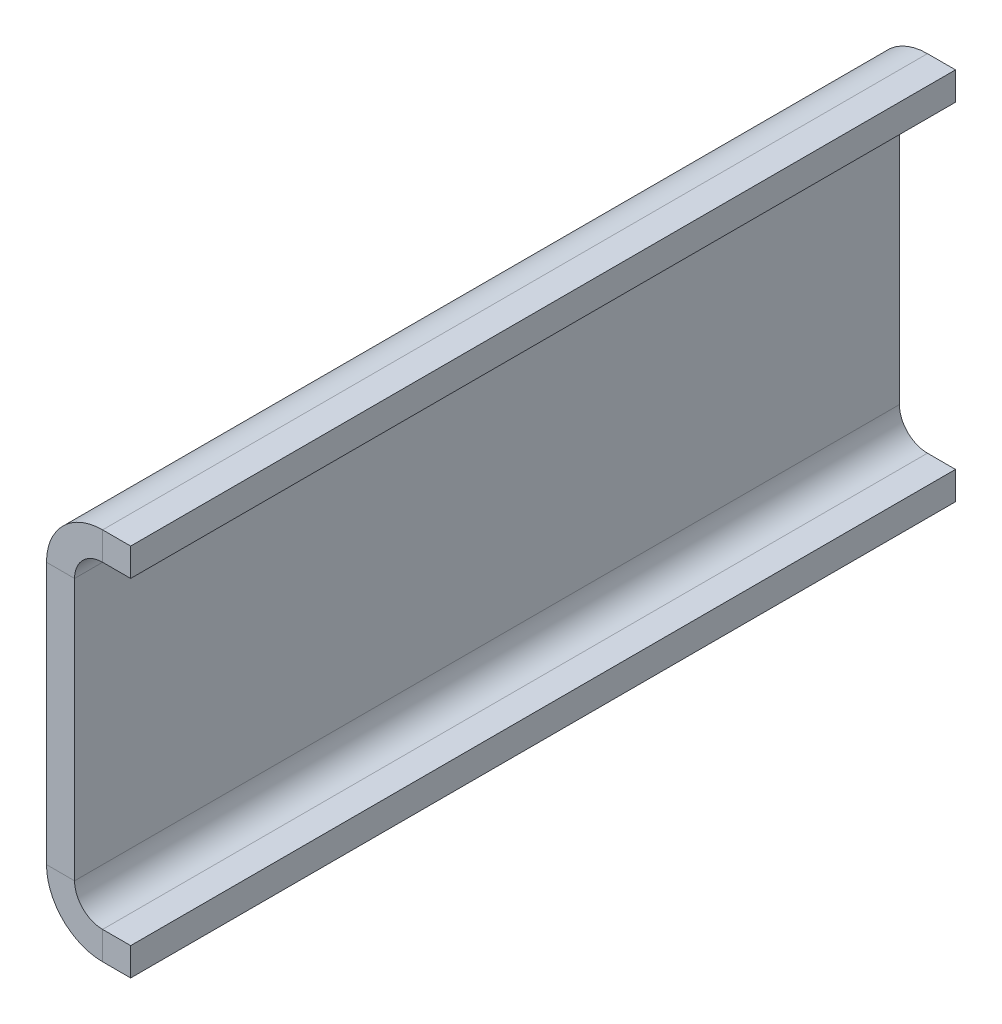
ISO-10303-21;
HEADER;
FILE_DESCRIPTION(('STEP AP214'),'2;1');
FILE_NAME('part.step','',(''),(''),'','','');
FILE_SCHEMA(('AUTOMOTIVE_DESIGN { 1 0 10303 214 1 1 1 1 }'));
ENDSEC;
DATA;
#1=APPLICATION_CONTEXT('core data for automotive mechanical design processes');
#2=APPLICATION_PROTOCOL_DEFINITION('international standard','automotive_design',2000,#1);
#3=PRODUCT_CONTEXT('',#1,'mechanical');
#4=PRODUCT('Part','Part','',(#3));
#5=PRODUCT_RELATED_PRODUCT_CATEGORY('part','',(#4));
#6=PRODUCT_DEFINITION_FORMATION('','',#4);
#7=PRODUCT_DEFINITION_CONTEXT('part definition',#1,'design');
#8=PRODUCT_DEFINITION('design','',#6,#7);
#9=PRODUCT_DEFINITION_SHAPE('','',#8);
#10=(LENGTH_UNIT() NAMED_UNIT(*) SI_UNIT(.MILLI.,.METRE.));
#11=(NAMED_UNIT(*) PLANE_ANGLE_UNIT() SI_UNIT($,.RADIAN.));
#12=(NAMED_UNIT(*) SI_UNIT($,.STERADIAN.) SOLID_ANGLE_UNIT());
#13=UNCERTAINTY_MEASURE_WITH_UNIT(LENGTH_MEASURE(1.E-05),#10,'distance_accuracy_value','');
#14=(GEOMETRIC_REPRESENTATION_CONTEXT(3) GLOBAL_UNCERTAINTY_ASSIGNED_CONTEXT((#13)) GLOBAL_UNIT_ASSIGNED_CONTEXT((#10,
#11,#12)) REPRESENTATION_CONTEXT('',''));
#15=CARTESIAN_POINT('',(0.,0.,0.));
#16=DIRECTION('',(0.,0.,1.));
#17=DIRECTION('',(1.,0.,0.));
#18=AXIS2_PLACEMENT_3D('',#15,#16,#17);
#19=CARTESIAN_POINT('',(-3.,-14.,88.2));
#20=DIRECTION('',(0.,0.,1.));
#21=DIRECTION('',(1.,0.,0.));
#22=AXIS2_PLACEMENT_3D('',#19,#20,#21);
#23=PLANE('',#22);
#24=DIRECTION('',(1.,0.,0.));
#25=VECTOR('',#24,1.);
#26=CARTESIAN_POINT('',(0.,-20.,88.2));
#27=LINE('',#26,#25);
#28=CARTESIAN_POINT('',(3.,-20.,88.2));
#29=VERTEX_POINT('',#28);
#30=CARTESIAN_POINT('',(6.00000000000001,-20.,88.2));
#31=VERTEX_POINT('',#30);
#32=EDGE_CURVE('E190',#29,#31,#27,.T.);
#33=ORIENTED_EDGE('',*,*,#32,.T.);
#34=DIRECTION('',(0.,-1.,0.));
#35=VECTOR('',#34,1.);
#36=CARTESIAN_POINT('',(6.00000000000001,-17.,88.2));
#37=LINE('',#36,#35);
#38=CARTESIAN_POINT('',(6.00000000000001,-17.,88.2));
#39=VERTEX_POINT('',#38);
#40=EDGE_CURVE('E148',#39,#31,#37,.T.);
#41=ORIENTED_EDGE('',*,*,#40,.F.);
#42=DIRECTION('',(1.,0.,0.));
#43=VECTOR('',#42,1.);
#44=CARTESIAN_POINT('',(0.,-17.,88.2));
#45=LINE('',#44,#43);
#46=CARTESIAN_POINT('',(3.,-17.,88.2));
#47=VERTEX_POINT('',#46);
#48=EDGE_CURVE('E146',#47,#39,#45,.T.);
#49=ORIENTED_EDGE('',*,*,#48,.F.);
#50=DIRECTION('',(0.,-1.,0.));
#51=VECTOR('',#50,1.);
#52=CARTESIAN_POINT('',(3.,-17.,88.2));
#53=LINE('',#52,#51);
#54=EDGE_CURVE('E231',#47,#29,#53,.T.);
#55=ORIENTED_EDGE('',*,*,#54,.T.);
#56=EDGE_LOOP('',(#33,#41,#49,#55));
#57=FACE_BOUND('',#56,.T.);
#58=ADVANCED_FACE('F41',(#57),#23,.T.);
#59=CARTESIAN_POINT('',(0.,-20.,88.2));
#60=DIRECTION('',(0.,1.,0.));
#61=DIRECTION('',(0.,0.,1.));
#62=AXIS2_PLACEMENT_3D('',#59,#60,#61);
#63=PLANE('',#62);
#64=DIRECTION('',(0.,0.,-1.));
#65=VECTOR('',#64,1.);
#66=CARTESIAN_POINT('',(6.00000000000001,-20.,88.2));
#67=LINE('',#66,#65);
#68=CARTESIAN_POINT('',(6.00000000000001,-20.,0.));
#69=VERTEX_POINT('',#68);
#70=EDGE_CURVE('E57',#31,#69,#67,.T.);
#71=ORIENTED_EDGE('',*,*,#70,.F.);
#72=ORIENTED_EDGE('',*,*,#32,.F.);
#73=DIRECTION('',(0.,0.,-1.));
#74=VECTOR('',#73,1.);
#75=CARTESIAN_POINT('',(3.,-20.,88.2));
#76=LINE('',#75,#74);
#77=CARTESIAN_POINT('',(3.,-20.,0.));
#78=VERTEX_POINT('',#77);
#79=EDGE_CURVE('E191',#29,#78,#76,.T.);
#80=ORIENTED_EDGE('',*,*,#79,.T.);
#81=DIRECTION('',(1.,0.,0.));
#82=VECTOR('',#81,1.);
#83=CARTESIAN_POINT('',(0.,-20.,0.));
#84=LINE('',#83,#82);
#85=EDGE_CURVE('E155',#78,#69,#84,.T.);
#86=ORIENTED_EDGE('',*,*,#85,.T.);
#87=EDGE_LOOP('',(#71,#72,#80,#86));
#88=FACE_BOUND('',#87,.T.);
#89=ADVANCED_FACE('F294',(#88),#63,.F.);
#90=CARTESIAN_POINT('',(0.,-17.,88.2));
#91=DIRECTION('',(0.,1.,0.));
#92=DIRECTION('',(0.,0.,1.));
#93=AXIS2_PLACEMENT_3D('',#90,#91,#92);
#94=PLANE('',#93);
#95=ORIENTED_EDGE('',*,*,#48,.T.);
#96=DIRECTION('',(0.,0.,1.));
#97=VECTOR('',#96,1.);
#98=CARTESIAN_POINT('',(6.00000000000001,-17.,0.));
#99=LINE('',#98,#97);
#100=CARTESIAN_POINT('',(6.00000000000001,-17.,0.));
#101=VERTEX_POINT('',#100);
#102=EDGE_CURVE('E130',#101,#39,#99,.T.);
#103=ORIENTED_EDGE('',*,*,#102,.F.);
#104=DIRECTION('',(1.,0.,0.));
#105=VECTOR('',#104,1.);
#106=CARTESIAN_POINT('',(0.,-17.,0.));
#107=LINE('',#106,#105);
#108=CARTESIAN_POINT('',(3.,-17.,0.));
#109=VERTEX_POINT('',#108);
#110=EDGE_CURVE('E143',#109,#101,#107,.T.);
#111=ORIENTED_EDGE('',*,*,#110,.F.);
#112=DIRECTION('',(0.,0.,-1.));
#113=VECTOR('',#112,1.);
#114=CARTESIAN_POINT('',(3.,-17.,88.2));
#115=LINE('',#114,#113);
#116=EDGE_CURVE('E220',#47,#109,#115,.T.);
#117=ORIENTED_EDGE('',*,*,#116,.F.);
#118=EDGE_LOOP('',(#95,#103,#111,#117));
#119=FACE_BOUND('',#118,.T.);
#120=ADVANCED_FACE('F141',(#119),#94,.T.);
#121=CARTESIAN_POINT('',(3.,-14.,0.));
#122=DIRECTION('',(0.,0.,-1.));
#123=DIRECTION('',(-1.,0.,0.));
#124=AXIS2_PLACEMENT_3D('',#121,#122,#123);
#125=PLANE('',#124);
#126=ORIENTED_EDGE('',*,*,#110,.T.);
#127=DIRECTION('',(0.,1.,0.));
#128=VECTOR('',#127,1.);
#129=CARTESIAN_POINT('',(6.00000000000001,-20.,0.));
#130=LINE('',#129,#128);
#131=EDGE_CURVE('E127',#69,#101,#130,.T.);
#132=ORIENTED_EDGE('',*,*,#131,.F.);
#133=ORIENTED_EDGE('',*,*,#85,.F.);
#134=DIRECTION('',(0.,1.,0.));
#135=VECTOR('',#134,1.);
#136=CARTESIAN_POINT('',(3.,-20.,0.));
#137=LINE('',#136,#135);
#138=EDGE_CURVE('E151',#78,#109,#137,.T.);
#139=ORIENTED_EDGE('',*,*,#138,.T.);
#140=EDGE_LOOP('',(#126,#132,#133,#139));
#141=FACE_BOUND('',#140,.T.);
#142=ADVANCED_FACE('F150',(#141),#125,.T.);
#143=CARTESIAN_POINT('',(-3.,14.,0.));
#144=DIRECTION('',(0.,0.,-1.));
#145=DIRECTION('',(-1.,0.,0.));
#146=AXIS2_PLACEMENT_3D('',#143,#144,#145);
#147=PLANE('',#146);
#148=DIRECTION('',(1.,0.,0.));
#149=VECTOR('',#148,1.);
#150=CARTESIAN_POINT('',(0.,20.,0.));
#151=LINE('',#150,#149);
#152=CARTESIAN_POINT('',(6.,20.,0.));
#153=VERTEX_POINT('',#152);
#154=CARTESIAN_POINT('',(3.,20.,0.));
#155=VERTEX_POINT('',#154);
#156=EDGE_CURVE('E175',#153,#155,#151,.F.);
#157=ORIENTED_EDGE('',*,*,#156,.F.);
#158=DIRECTION('',(0.,1.,0.));
#159=VECTOR('',#158,1.);
#160=CARTESIAN_POINT('',(6.,17.,0.));
#161=LINE('',#160,#159);
#162=CARTESIAN_POINT('',(6.,17.,0.));
#163=VERTEX_POINT('',#162);
#164=EDGE_CURVE('E338',#163,#153,#161,.T.);
#165=ORIENTED_EDGE('',*,*,#164,.F.);
#166=DIRECTION('',(-1.,0.,0.));
#167=VECTOR('',#166,1.);
#168=CARTESIAN_POINT('',(0.,17.,0.));
#169=LINE('',#168,#167);
#170=CARTESIAN_POINT('',(3.,17.,0.));
#171=VERTEX_POINT('',#170);
#172=EDGE_CURVE('E172',#163,#171,#169,.T.);
#173=ORIENTED_EDGE('',*,*,#172,.T.);
#174=DIRECTION('',(0.,1.,0.));
#175=VECTOR('',#174,1.);
#176=CARTESIAN_POINT('',(3.,17.,0.));
#177=LINE('',#176,#175);
#178=EDGE_CURVE('E237',#171,#155,#177,.T.);
#179=ORIENTED_EDGE('',*,*,#178,.T.);
#180=EDGE_LOOP('',(#157,#165,#173,#179));
#181=FACE_BOUND('',#180,.T.);
#182=ADVANCED_FACE('F329',(#181),#147,.T.);
#183=CARTESIAN_POINT('',(0.,17.,88.2));
#184=DIRECTION('',(0.,-1.,0.));
#185=DIRECTION('',(0.,0.,-1.));
#186=AXIS2_PLACEMENT_3D('',#183,#184,#185);
#187=PLANE('',#186);
#188=ORIENTED_EDGE('',*,*,#172,.F.);
#189=DIRECTION('',(0.,0.,-1.));
#190=VECTOR('',#189,1.);
#191=CARTESIAN_POINT('',(6.,17.,88.2));
#192=LINE('',#191,#190);
#193=CARTESIAN_POINT('',(6.,17.,88.2));
#194=VERTEX_POINT('',#193);
#195=EDGE_CURVE('E341',#194,#163,#192,.T.);
#196=ORIENTED_EDGE('',*,*,#195,.F.);
#197=DIRECTION('',(-1.,0.,0.));
#198=VECTOR('',#197,1.);
#199=CARTESIAN_POINT('',(0.,17.,88.2));
#200=LINE('',#199,#198);
#201=CARTESIAN_POINT('',(3.,17.,88.2));
#202=VERTEX_POINT('',#201);
#203=EDGE_CURVE('E247',#194,#202,#200,.T.);
#204=ORIENTED_EDGE('',*,*,#203,.T.);
#205=DIRECTION('',(0.,0.,-1.));
#206=VECTOR('',#205,1.);
#207=CARTESIAN_POINT('',(3.,17.,88.2));
#208=LINE('',#207,#206);
#209=EDGE_CURVE('E208',#202,#171,#208,.T.);
#210=ORIENTED_EDGE('',*,*,#209,.T.);
#211=EDGE_LOOP('',(#188,#196,#204,#210));
#212=FACE_BOUND('',#211,.T.);
#213=ADVANCED_FACE('F362',(#212),#187,.T.);
#214=CARTESIAN_POINT('',(0.,20.,88.2));
#215=DIRECTION('',(0.,-1.,0.));
#216=DIRECTION('',(0.,0.,-1.));
#217=AXIS2_PLACEMENT_3D('',#214,#215,#216);
#218=PLANE('',#217);
#219=DIRECTION('',(0.,0.,1.));
#220=VECTOR('',#219,1.);
#221=CARTESIAN_POINT('',(6.,20.,0.));
#222=LINE('',#221,#220);
#223=CARTESIAN_POINT('',(6.,20.,88.2));
#224=VERTEX_POINT('',#223);
#225=EDGE_CURVE('E65',#153,#224,#222,.T.);
#226=ORIENTED_EDGE('',*,*,#225,.F.);
#227=ORIENTED_EDGE('',*,*,#156,.T.);
#228=DIRECTION('',(0.,0.,-1.));
#229=VECTOR('',#228,1.);
#230=CARTESIAN_POINT('',(3.,20.,88.2));
#231=LINE('',#230,#229);
#232=CARTESIAN_POINT('',(3.,20.,88.2));
#233=VERTEX_POINT('',#232);
#234=EDGE_CURVE('E204',#233,#155,#231,.T.);
#235=ORIENTED_EDGE('',*,*,#234,.F.);
#236=DIRECTION('',(1.,0.,0.));
#237=VECTOR('',#236,1.);
#238=CARTESIAN_POINT('',(0.,20.,88.2));
#239=LINE('',#238,#237);
#240=EDGE_CURVE('E249',#224,#233,#239,.F.);
#241=ORIENTED_EDGE('',*,*,#240,.F.);
#242=EDGE_LOOP('',(#226,#227,#235,#241));
#243=FACE_BOUND('',#242,.T.);
#244=ADVANCED_FACE('F336',(#243),#218,.F.);
#245=CARTESIAN_POINT('',(3.,-14.,88.2));
#246=DIRECTION('',(0.,0.,-1.));
#247=DIRECTION('',(-1.,0.,0.));
#248=AXIS2_PLACEMENT_3D('',#245,#246,#247);
#249=PLANE('',#248);
#250=DIRECTION('',(0.,-1.,0.));
#251=VECTOR('',#250,1.);
#252=CARTESIAN_POINT('',(6.,20.,88.2));
#253=LINE('',#252,#251);
#254=EDGE_CURVE('E161',#224,#194,#253,.T.);
#255=ORIENTED_EDGE('',*,*,#254,.F.);
#256=ORIENTED_EDGE('',*,*,#240,.T.);
#257=DIRECTION('',(0.,-1.,0.));
#258=VECTOR('',#257,1.);
#259=CARTESIAN_POINT('',(3.,20.,88.2));
#260=LINE('',#259,#258);
#261=EDGE_CURVE('E50',#233,#202,#260,.T.);
#262=ORIENTED_EDGE('',*,*,#261,.T.);
#263=ORIENTED_EDGE('',*,*,#203,.F.);
#264=EDGE_LOOP('',(#255,#256,#262,#263));
#265=FACE_BOUND('',#264,.T.);
#266=ADVANCED_FACE('F246',(#265),#249,.F.);
#267=CARTESIAN_POINT('',(0.,14.,88.2));
#268=DIRECTION('',(0.,0.,1.));
#269=DIRECTION('',(1.,0.,0.));
#270=AXIS2_PLACEMENT_3D('',#267,#268,#269);
#271=PLANE('',#270);
#272=DIRECTION('',(-1.,0.,0.));
#273=VECTOR('',#272,1.);
#274=CARTESIAN_POINT('',(0.,14.,88.2));
#275=LINE('',#274,#273);
#276=CARTESIAN_POINT('',(0.,14.,88.2));
#277=VERTEX_POINT('',#276);
#278=CARTESIAN_POINT('',(-3.,14.,88.2));
#279=VERTEX_POINT('',#278);
#280=EDGE_CURVE('E11',#277,#279,#275,.T.);
#281=ORIENTED_EDGE('',*,*,#280,.F.);
#282=CARTESIAN_POINT('',(3.,14.,88.2));
#283=DIRECTION('',(0.,0.,-1.));
#284=DIRECTION('',(-1.,0.,0.));
#285=AXIS2_PLACEMENT_3D('',#282,#283,#284);
#286=CIRCLE('',#285,3.);
#287=EDGE_CURVE('E258',#202,#277,#286,.F.);
#288=ORIENTED_EDGE('',*,*,#287,.F.);
#289=ORIENTED_EDGE('',*,*,#261,.F.);
#290=CARTESIAN_POINT('',(3.,14.,88.2));
#291=DIRECTION('',(0.,0.,1.));
#292=DIRECTION('',(1.,0.,0.));
#293=AXIS2_PLACEMENT_3D('',#290,#291,#292);
#294=CIRCLE('',#293,6.);
#295=EDGE_CURVE('E275',#233,#279,#294,.T.);
#296=ORIENTED_EDGE('',*,*,#295,.T.);
#297=EDGE_LOOP('',(#281,#288,#289,#296));
#298=FACE_BOUND('',#297,.T.);
#299=ADVANCED_FACE('F43',(#298),#271,.T.);
#300=CARTESIAN_POINT('',(3.,20.,88.2));
#301=DIRECTION('',(0.,0.,1.));
#302=DIRECTION('',(1.,0.,0.));
#303=AXIS2_PLACEMENT_3D('',#300,#301,#302);
#304=PLANE('',#303);
#305=DIRECTION('',(0.,-1.,0.));
#306=VECTOR('',#305,1.);
#307=CARTESIAN_POINT('',(0.,0.,88.2));
#308=LINE('',#307,#306);
#309=CARTESIAN_POINT('',(0.,-14.,88.2));
#310=VERTEX_POINT('',#309);
#311=EDGE_CURVE('E263',#277,#310,#308,.T.);
#312=ORIENTED_EDGE('',*,*,#311,.F.);
#313=ORIENTED_EDGE('',*,*,#280,.T.);
#314=DIRECTION('',(0.,1.,0.));
#315=VECTOR('',#314,1.);
#316=CARTESIAN_POINT('',(-3.,0.,88.2));
#317=LINE('',#316,#315);
#318=CARTESIAN_POINT('',(-3.,-14.,88.2));
#319=VERTEX_POINT('',#318);
#320=EDGE_CURVE('E278',#279,#319,#317,.F.);
#321=ORIENTED_EDGE('',*,*,#320,.T.);
#322=DIRECTION('',(1.,0.,0.));
#323=VECTOR('',#322,1.);
#324=CARTESIAN_POINT('',(-3.,-14.,88.2));
#325=LINE('',#324,#323);
#326=EDGE_CURVE('E228',#319,#310,#325,.T.);
#327=ORIENTED_EDGE('',*,*,#326,.T.);
#328=EDGE_LOOP('',(#312,#313,#321,#327));
#329=FACE_BOUND('',#328,.T.);
#330=ADVANCED_FACE('F313',(#329),#304,.T.);
#331=CARTESIAN_POINT('',(3.,17.,0.));
#332=DIRECTION('',(0.,0.,-1.));
#333=DIRECTION('',(-1.,0.,0.));
#334=AXIS2_PLACEMENT_3D('',#331,#332,#333);
#335=PLANE('',#334);
#336=ORIENTED_EDGE('',*,*,#178,.F.);
#337=CARTESIAN_POINT('',(3.,14.,0.));
#338=DIRECTION('',(0.,0.,-1.));
#339=DIRECTION('',(-1.,0.,0.));
#340=AXIS2_PLACEMENT_3D('',#337,#338,#339);
#341=CIRCLE('',#340,3.);
#342=CARTESIAN_POINT('',(0.,14.,0.));
#343=VERTEX_POINT('',#342);
#344=EDGE_CURVE('E168',#171,#343,#341,.F.);
#345=ORIENTED_EDGE('',*,*,#344,.T.);
#346=DIRECTION('',(1.,0.,0.));
#347=VECTOR('',#346,1.);
#348=CARTESIAN_POINT('',(-3.,14.,0.));
#349=LINE('',#348,#347);
#350=CARTESIAN_POINT('',(-3.,14.,0.));
#351=VERTEX_POINT('',#350);
#352=EDGE_CURVE('E234',#351,#343,#349,.T.);
#353=ORIENTED_EDGE('',*,*,#352,.F.);
#354=CARTESIAN_POINT('',(3.,14.,0.));
#355=DIRECTION('',(0.,0.,1.));
#356=DIRECTION('',(1.,0.,0.));
#357=AXIS2_PLACEMENT_3D('',#354,#355,#356);
#358=CIRCLE('',#357,6.);
#359=EDGE_CURVE('E178',#155,#351,#358,.T.);
#360=ORIENTED_EDGE('',*,*,#359,.F.);
#361=EDGE_LOOP('',(#336,#345,#353,#360));
#362=FACE_BOUND('',#361,.T.);
#363=ADVANCED_FACE('F325',(#362),#335,.T.);
#364=CARTESIAN_POINT('',(3.,-17.,88.2));
#365=DIRECTION('',(0.,0.,1.));
#366=DIRECTION('',(1.,0.,0.));
#367=AXIS2_PLACEMENT_3D('',#364,#365,#366);
#368=PLANE('',#367);
#369=ORIENTED_EDGE('',*,*,#54,.F.);
#370=CARTESIAN_POINT('',(3.,-14.,88.2));
#371=DIRECTION('',(0.,0.,-1.));
#372=DIRECTION('',(-1.,0.,0.));
#373=AXIS2_PLACEMENT_3D('',#370,#371,#372);
#374=CIRCLE('',#373,3.);
#375=EDGE_CURVE('E269',#310,#47,#374,.F.);
#376=ORIENTED_EDGE('',*,*,#375,.F.);
#377=ORIENTED_EDGE('',*,*,#326,.F.);
#378=CARTESIAN_POINT('',(3.,-14.,88.2));
#379=DIRECTION('',(0.,0.,1.));
#380=DIRECTION('',(1.,0.,0.));
#381=AXIS2_PLACEMENT_3D('',#378,#379,#380);
#382=CIRCLE('',#381,6.);
#383=EDGE_CURVE('E196',#319,#29,#382,.T.);
#384=ORIENTED_EDGE('',*,*,#383,.T.);
#385=EDGE_LOOP('',(#369,#376,#377,#384));
#386=FACE_BOUND('',#385,.T.);
#387=ADVANCED_FACE('F286',(#386),#368,.T.);
#388=CARTESIAN_POINT('',(0.,-14.,0.));
#389=DIRECTION('',(0.,0.,-1.));
#390=DIRECTION('',(-1.,0.,0.));
#391=AXIS2_PLACEMENT_3D('',#388,#389,#390);
#392=PLANE('',#391);
#393=DIRECTION('',(-1.,0.,0.));
#394=VECTOR('',#393,1.);
#395=CARTESIAN_POINT('',(0.,-14.,0.));
#396=LINE('',#395,#394);
#397=CARTESIAN_POINT('',(0.,-14.,0.));
#398=VERTEX_POINT('',#397);
#399=CARTESIAN_POINT('',(-3.,-14.,0.));
#400=VERTEX_POINT('',#399);
#401=EDGE_CURVE('E225',#398,#400,#396,.T.);
#402=ORIENTED_EDGE('',*,*,#401,.F.);
#403=CARTESIAN_POINT('',(3.,-14.,0.));
#404=DIRECTION('',(0.,0.,-1.));
#405=DIRECTION('',(-1.,0.,0.));
#406=AXIS2_PLACEMENT_3D('',#403,#404,#405);
#407=CIRCLE('',#406,3.);
#408=EDGE_CURVE('E154',#398,#109,#407,.F.);
#409=ORIENTED_EDGE('',*,*,#408,.T.);
#410=ORIENTED_EDGE('',*,*,#138,.F.);
#411=CARTESIAN_POINT('',(3.,-14.,0.));
#412=DIRECTION('',(0.,0.,1.));
#413=DIRECTION('',(1.,0.,0.));
#414=AXIS2_PLACEMENT_3D('',#411,#412,#413);
#415=CIRCLE('',#414,6.);
#416=EDGE_CURVE('E186',#400,#78,#415,.T.);
#417=ORIENTED_EDGE('',*,*,#416,.F.);
#418=EDGE_LOOP('',(#402,#409,#410,#417));
#419=FACE_BOUND('',#418,.T.);
#420=ADVANCED_FACE('F320',(#419),#392,.T.);
#421=CARTESIAN_POINT('',(3.,-20.,0.));
#422=DIRECTION('',(0.,0.,-1.));
#423=DIRECTION('',(-1.,0.,0.));
#424=AXIS2_PLACEMENT_3D('',#421,#422,#423);
#425=PLANE('',#424);
#426=DIRECTION('',(0.,-1.,0.));
#427=VECTOR('',#426,1.);
#428=CARTESIAN_POINT('',(0.,0.,0.));
#429=LINE('',#428,#427);
#430=EDGE_CURVE('E159',#343,#398,#429,.T.);
#431=ORIENTED_EDGE('',*,*,#430,.T.);
#432=ORIENTED_EDGE('',*,*,#401,.T.);
#433=DIRECTION('',(0.,-1.,0.));
#434=VECTOR('',#433,1.);
#435=CARTESIAN_POINT('',(-3.,0.,0.));
#436=LINE('',#435,#434);
#437=EDGE_CURVE('E182',#351,#400,#436,.T.);
#438=ORIENTED_EDGE('',*,*,#437,.F.);
#439=ORIENTED_EDGE('',*,*,#352,.T.);
#440=EDGE_LOOP('',(#431,#432,#438,#439));
#441=FACE_BOUND('',#440,.T.);
#442=ADVANCED_FACE('F322',(#441),#425,.T.);
#443=CARTESIAN_POINT('',(3.,-14.,88.2));
#444=DIRECTION('',(0.,0.,-1.));
#445=DIRECTION('',(-1.,0.,0.));
#446=AXIS2_PLACEMENT_3D('',#443,#444,#445);
#447=CYLINDRICAL_SURFACE('',#446,3.);
#448=ORIENTED_EDGE('',*,*,#408,.F.);
#449=DIRECTION('',(0.,0.,-1.));
#450=VECTOR('',#449,1.);
#451=CARTESIAN_POINT('',(0.,-14.,88.2));
#452=LINE('',#451,#450);
#453=EDGE_CURVE('E216',#310,#398,#452,.T.);
#454=ORIENTED_EDGE('',*,*,#453,.F.);
#455=ORIENTED_EDGE('',*,*,#375,.T.);
#456=ORIENTED_EDGE('',*,*,#116,.T.);
#457=EDGE_LOOP('',(#448,#454,#455,#456));
#458=FACE_BOUND('',#457,.T.);
#459=ADVANCED_FACE('F307',(#458),#447,.F.);
#460=CARTESIAN_POINT('',(0.,0.,88.2));
#461=DIRECTION('',(1.,0.,0.));
#462=DIRECTION('',(0.,0.,-1.));
#463=AXIS2_PLACEMENT_3D('',#460,#461,#462);
#464=PLANE('',#463);
#465=ORIENTED_EDGE('',*,*,#430,.F.);
#466=DIRECTION('',(0.,0.,-1.));
#467=VECTOR('',#466,1.);
#468=CARTESIAN_POINT('',(0.,14.,88.2));
#469=LINE('',#468,#467);
#470=EDGE_CURVE('E212',#277,#343,#469,.T.);
#471=ORIENTED_EDGE('',*,*,#470,.F.);
#472=ORIENTED_EDGE('',*,*,#311,.T.);
#473=ORIENTED_EDGE('',*,*,#453,.T.);
#474=EDGE_LOOP('',(#465,#471,#472,#473));
#475=FACE_BOUND('',#474,.T.);
#476=ADVANCED_FACE('F311',(#475),#464,.T.);
#477=CARTESIAN_POINT('',(3.,14.,88.2));
#478=DIRECTION('',(0.,0.,-1.));
#479=DIRECTION('',(-1.,0.,0.));
#480=AXIS2_PLACEMENT_3D('',#477,#478,#479);
#481=CYLINDRICAL_SURFACE('',#480,3.);
#482=ORIENTED_EDGE('',*,*,#344,.F.);
#483=ORIENTED_EDGE('',*,*,#209,.F.);
#484=ORIENTED_EDGE('',*,*,#287,.T.);
#485=ORIENTED_EDGE('',*,*,#470,.T.);
#486=EDGE_LOOP('',(#482,#483,#484,#485));
#487=FACE_BOUND('',#486,.T.);
#488=ADVANCED_FACE('F257',(#487),#481,.F.);
#489=CARTESIAN_POINT('',(3.,14.,88.2));
#490=DIRECTION('',(0.,0.,-1.));
#491=DIRECTION('',(-1.,0.,0.));
#492=AXIS2_PLACEMENT_3D('',#489,#490,#491);
#493=CYLINDRICAL_SURFACE('',#492,6.);
#494=ORIENTED_EDGE('',*,*,#359,.T.);
#495=DIRECTION('',(0.,0.,-1.));
#496=VECTOR('',#495,1.);
#497=CARTESIAN_POINT('',(-3.,14.,88.2));
#498=LINE('',#497,#496);
#499=EDGE_CURVE('E200',#279,#351,#498,.T.);
#500=ORIENTED_EDGE('',*,*,#499,.F.);
#501=ORIENTED_EDGE('',*,*,#295,.F.);
#502=ORIENTED_EDGE('',*,*,#234,.T.);
#503=EDGE_LOOP('',(#494,#500,#501,#502));
#504=FACE_BOUND('',#503,.T.);
#505=ADVANCED_FACE('F333',(#504),#493,.T.);
#506=CARTESIAN_POINT('',(-3.,0.,88.2));
#507=DIRECTION('',(1.,0.,0.));
#508=DIRECTION('',(0.,1.,0.));
#509=AXIS2_PLACEMENT_3D('',#506,#507,#508);
#510=PLANE('',#509);
#511=ORIENTED_EDGE('',*,*,#437,.T.);
#512=DIRECTION('',(0.,0.,-1.));
#513=VECTOR('',#512,1.);
#514=CARTESIAN_POINT('',(-3.,-14.,88.2));
#515=LINE('',#514,#513);
#516=EDGE_CURVE('E195',#319,#400,#515,.T.);
#517=ORIENTED_EDGE('',*,*,#516,.F.);
#518=ORIENTED_EDGE('',*,*,#320,.F.);
#519=ORIENTED_EDGE('',*,*,#499,.T.);
#520=EDGE_LOOP('',(#511,#517,#518,#519));
#521=FACE_BOUND('',#520,.T.);
#522=ADVANCED_FACE('F317',(#521),#510,.F.);
#523=CARTESIAN_POINT('',(3.,-14.,88.2));
#524=DIRECTION('',(0.,0.,-1.));
#525=DIRECTION('',(-1.,0.,0.));
#526=AXIS2_PLACEMENT_3D('',#523,#524,#525);
#527=CYLINDRICAL_SURFACE('',#526,6.);
#528=ORIENTED_EDGE('',*,*,#416,.T.);
#529=ORIENTED_EDGE('',*,*,#79,.F.);
#530=ORIENTED_EDGE('',*,*,#383,.F.);
#531=ORIENTED_EDGE('',*,*,#516,.T.);
#532=EDGE_LOOP('',(#528,#529,#530,#531));
#533=FACE_BOUND('',#532,.T.);
#534=ADVANCED_FACE('F290',(#533),#527,.T.);
#535=CARTESIAN_POINT('',(6.,0.,0.));
#536=DIRECTION('',(1.,0.,0.));
#537=DIRECTION('',(0.,0.,-1.));
#538=AXIS2_PLACEMENT_3D('',#535,#536,#537);
#539=PLANE('',#538);
#540=ORIENTED_EDGE('',*,*,#195,.T.);
#541=ORIENTED_EDGE('',*,*,#164,.T.);
#542=ORIENTED_EDGE('',*,*,#225,.T.);
#543=ORIENTED_EDGE('',*,*,#254,.T.);
#544=EDGE_LOOP('',(#540,#541,#542,#543));
#545=FACE_BOUND('',#544,.T.);
#546=ADVANCED_FACE('F378',(#545),#539,.T.);
#547=CARTESIAN_POINT('',(6.00000000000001,0.,0.));
#548=DIRECTION('',(1.,0.,0.));
#549=DIRECTION('',(0.,0.,-1.));
#550=AXIS2_PLACEMENT_3D('',#547,#548,#549);
#551=PLANE('',#550);
#552=ORIENTED_EDGE('',*,*,#70,.T.);
#553=ORIENTED_EDGE('',*,*,#131,.T.);
#554=ORIENTED_EDGE('',*,*,#102,.T.);
#555=ORIENTED_EDGE('',*,*,#40,.T.);
#556=EDGE_LOOP('',(#552,#553,#554,#555));
#557=FACE_BOUND('',#556,.T.);
#558=ADVANCED_FACE('F129',(#557),#551,.T.);
#559=CLOSED_SHELL('',(#58,#89,#120,#142,#182,#213,#244,#266,#299,#330,#363,#387,#420,#442,#459,
#476,#488,#505,#522,#534,#546,#558));
#560=MANIFOLD_SOLID_BREP('B2',#559);
#561=ADVANCED_BREP_SHAPE_REPRESENTATION('',(#18,#560),#14);
#562=SHAPE_DEFINITION_REPRESENTATION(#9,#561);
ENDSEC;
END-ISO-10303-21;
